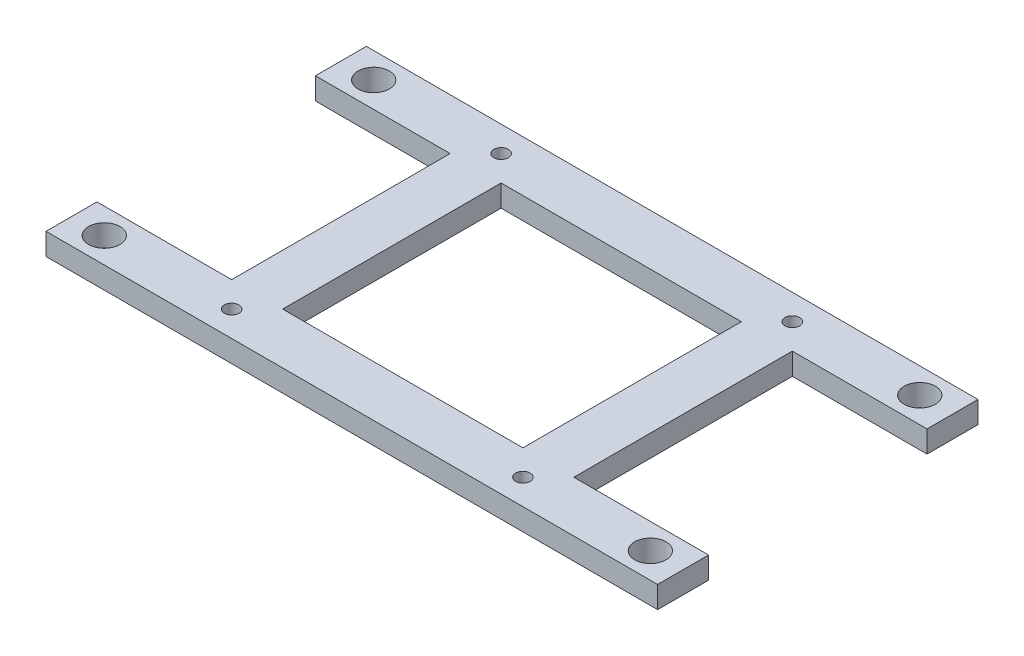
from build123d import *

# Parameters (mm, degrees)
SKETCH1_R           = 1
SKETCH1_R_2         = 2.15
SKETCH1_W           = 33
SKETCH1_H           = 30
BOSS_EXTRUDE1_DEPTH = 1.5


with BuildPart() as part:
    # Sketch1 → Boss-Extrude1 (new, symmetric)
    with BuildSketch(Plane(origin=(0, 0, 0), x_dir=(1, 0, 0), z_dir=(0, 1, 0))):
        Polygon((-42, 22), (42, 22), (42, 15), (23.5, 15), (23.5, -15), (42, -15), (42, -22), (-42, -22), (-42, -15), (-23.5, -15), (-23.5, 15), (-42, 15), align=None)
        with Locations(Location((-20, 18.5, 0), (0, 0, 270))):
            Circle(SKETCH1_R, mode=Mode.SUBTRACT)
        with Locations(Location((20, 18.5, 0), (0, 0, 270))):
            Circle(SKETCH1_R, mode=Mode.SUBTRACT)
        with Locations(Location((20, -18.5, 0), (0, 0, 270))):
            Circle(SKETCH1_R, mode=Mode.SUBTRACT)
        with Locations(Location((-20, -18.5, 0), (0, 0, 270))):
            Circle(SKETCH1_R, mode=Mode.SUBTRACT)
        with Locations(Location((-37.5, 18.5, 0), (0, 0, 270))):
            Circle(SKETCH1_R_2, mode=Mode.SUBTRACT)
        with Locations(Location((-37.5, -18.5, 0), (0, 0, 270))):
            Circle(SKETCH1_R_2, mode=Mode.SUBTRACT)
        with Locations(Location((37.5, -18.5, 0), (0, 0, 270))):
            Circle(SKETCH1_R_2, mode=Mode.SUBTRACT)
        with Locations(Location((37.5, 18.5, 0), (0, 0, 270))):
            Circle(SKETCH1_R_2, mode=Mode.SUBTRACT)
        Rectangle(SKETCH1_W, SKETCH1_H, mode=Mode.SUBTRACT)
    extrude(amount=BOSS_EXTRUDE1_DEPTH, both=True)


solid = part.part
